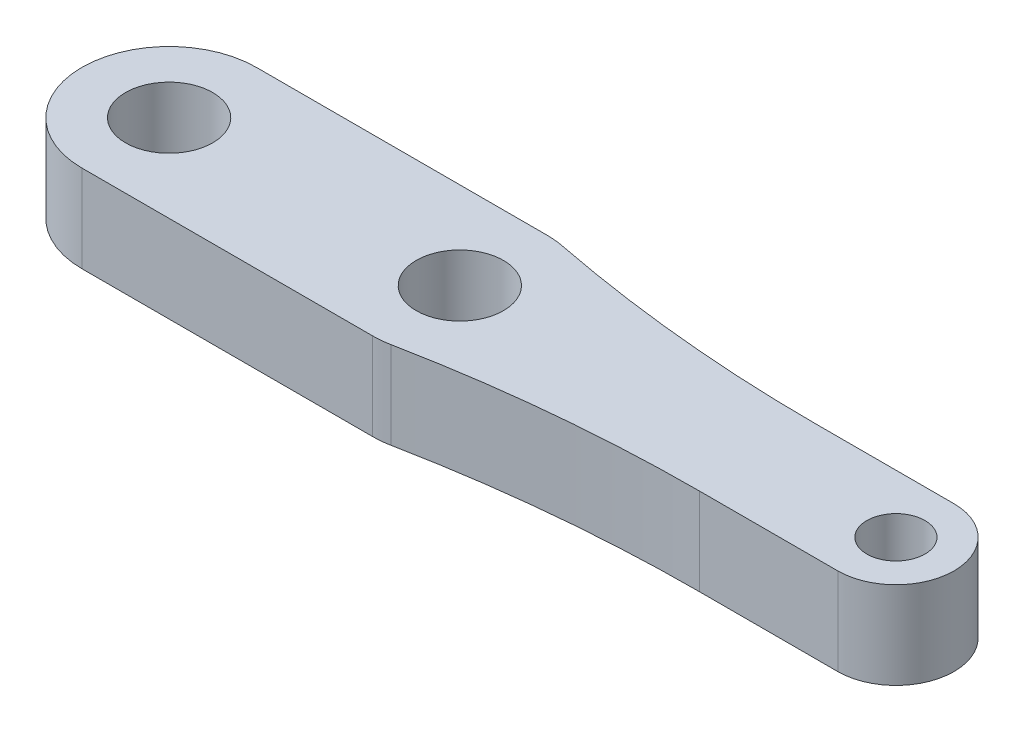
ISO-10303-21;
HEADER;
FILE_DESCRIPTION(('STEP AP214'),'2;1');
FILE_NAME('part.step','',(''),(''),'','','');
FILE_SCHEMA(('AUTOMOTIVE_DESIGN { 1 0 10303 214 1 1 1 1 }'));
ENDSEC;
DATA;
#1=APPLICATION_CONTEXT('core data for automotive mechanical design processes');
#2=APPLICATION_PROTOCOL_DEFINITION('international standard','automotive_design',2000,#1);
#3=PRODUCT_CONTEXT('',#1,'mechanical');
#4=PRODUCT('Part','Part','',(#3));
#5=PRODUCT_RELATED_PRODUCT_CATEGORY('part','',(#4));
#6=PRODUCT_DEFINITION_FORMATION('','',#4);
#7=PRODUCT_DEFINITION_CONTEXT('part definition',#1,'design');
#8=PRODUCT_DEFINITION('design','',#6,#7);
#9=PRODUCT_DEFINITION_SHAPE('','',#8);
#10=(LENGTH_UNIT() NAMED_UNIT(*) SI_UNIT(.MILLI.,.METRE.));
#11=(NAMED_UNIT(*) PLANE_ANGLE_UNIT() SI_UNIT($,.RADIAN.));
#12=(NAMED_UNIT(*) SI_UNIT($,.STERADIAN.) SOLID_ANGLE_UNIT());
#13=UNCERTAINTY_MEASURE_WITH_UNIT(LENGTH_MEASURE(1.E-05),#10,'distance_accuracy_value','');
#14=(GEOMETRIC_REPRESENTATION_CONTEXT(3) GLOBAL_UNCERTAINTY_ASSIGNED_CONTEXT((#13)) GLOBAL_UNIT_ASSIGNED_CONTEXT((#10,
#11,#12)) REPRESENTATION_CONTEXT('',''));
#15=CARTESIAN_POINT('',(0.,0.,0.));
#16=DIRECTION('',(0.,0.,1.));
#17=DIRECTION('',(1.,0.,0.));
#18=AXIS2_PLACEMENT_3D('',#15,#16,#17);
#19=CARTESIAN_POINT('',(0.,3.,2.));
#20=DIRECTION('',(0.,0.,1.));
#21=DIRECTION('',(1.,0.,0.));
#22=AXIS2_PLACEMENT_3D('',#19,#20,#21);
#23=PLANE('',#22);
#24=DIRECTION('',(-1.,0.,0.));
#25=VECTOR('',#24,1.);
#26=CARTESIAN_POINT('',(0.,3.,2.));
#27=LINE('',#26,#25);
#28=CARTESIAN_POINT('',(25.,3.,2.));
#29=VERTEX_POINT('',#28);
#30=CARTESIAN_POINT('',(20.2469507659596,3.,2.));
#31=VERTEX_POINT('',#30);
#32=EDGE_CURVE('E129',#29,#31,#27,.T.);
#33=ORIENTED_EDGE('',*,*,#32,.T.);
#34=DIRECTION('',(0.,-1.,0.));
#35=VECTOR('',#34,1.);
#36=CARTESIAN_POINT('',(20.2469507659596,3.,2.));
#37=LINE('',#36,#35);
#38=CARTESIAN_POINT('',(20.2469507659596,0.,2.));
#39=VERTEX_POINT('',#38);
#40=EDGE_CURVE('E137',#31,#39,#37,.T.);
#41=ORIENTED_EDGE('',*,*,#40,.T.);
#42=DIRECTION('',(-1.,0.,0.));
#43=VECTOR('',#42,1.);
#44=CARTESIAN_POINT('',(0.,0.,2.));
#45=LINE('',#44,#43);
#46=CARTESIAN_POINT('',(25.,0.,2.));
#47=VERTEX_POINT('',#46);
#48=EDGE_CURVE('E132',#47,#39,#45,.T.);
#49=ORIENTED_EDGE('',*,*,#48,.F.);
#50=DIRECTION('',(0.,-1.,0.));
#51=VECTOR('',#50,1.);
#52=CARTESIAN_POINT('',(25.,3.,2.));
#53=LINE('',#52,#51);
#54=EDGE_CURVE('E125',#29,#47,#53,.T.);
#55=ORIENTED_EDGE('',*,*,#54,.F.);
#56=EDGE_LOOP('',(#33,#41,#49,#55));
#57=FACE_BOUND('',#56,.T.);
#58=ADVANCED_FACE('F49',(#57),#23,.T.);
#59=CARTESIAN_POINT('',(25.,3.,0.));
#60=DIRECTION('',(0.,-1.,0.));
#61=DIRECTION('',(0.,0.,-1.));
#62=AXIS2_PLACEMENT_3D('',#59,#60,#61);
#63=CYLINDRICAL_SURFACE('',#62,2.);
#64=CARTESIAN_POINT('',(25.,0.,0.));
#65=DIRECTION('',(0.,1.,0.));
#66=DIRECTION('',(0.,0.,1.));
#67=AXIS2_PLACEMENT_3D('',#64,#65,#66);
#68=CIRCLE('',#67,2.);
#69=CARTESIAN_POINT('',(25.,0.,-2.));
#70=VERTEX_POINT('',#69);
#71=EDGE_CURVE('E195',#47,#70,#68,.T.);
#72=ORIENTED_EDGE('',*,*,#71,.T.);
#73=DIRECTION('',(0.,-1.,0.));
#74=VECTOR('',#73,1.);
#75=CARTESIAN_POINT('',(25.,3.,-2.));
#76=LINE('',#75,#74);
#77=CARTESIAN_POINT('',(25.,3.,-2.));
#78=VERTEX_POINT('',#77);
#79=EDGE_CURVE('E138',#78,#70,#76,.T.);
#80=ORIENTED_EDGE('',*,*,#79,.F.);
#81=CARTESIAN_POINT('',(25.,3.,0.));
#82=DIRECTION('',(0.,1.,0.));
#83=DIRECTION('',(0.,0.,1.));
#84=AXIS2_PLACEMENT_3D('',#81,#82,#83);
#85=CIRCLE('',#84,2.);
#86=EDGE_CURVE('E142',#29,#78,#85,.T.);
#87=ORIENTED_EDGE('',*,*,#86,.F.);
#88=ORIENTED_EDGE('',*,*,#54,.T.);
#89=EDGE_LOOP('',(#72,#80,#87,#88));
#90=FACE_BOUND('',#89,.T.);
#91=ADVANCED_FACE('F143',(#90),#63,.T.);
#92=CARTESIAN_POINT('',(0.,3.,-2.));
#93=DIRECTION('',(0.,0.,1.));
#94=DIRECTION('',(1.,0.,0.));
#95=AXIS2_PLACEMENT_3D('',#92,#93,#94);
#96=PLANE('',#95);
#97=DIRECTION('',(-1.,0.,0.));
#98=VECTOR('',#97,1.);
#99=CARTESIAN_POINT('',(0.,0.,-2.));
#100=LINE('',#99,#98);
#101=CARTESIAN_POINT('',(20.2469507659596,0.,-2.));
#102=VERTEX_POINT('',#101);
#103=EDGE_CURVE('E198',#70,#102,#100,.T.);
#104=ORIENTED_EDGE('',*,*,#103,.T.);
#105=DIRECTION('',(0.,1.,0.));
#106=VECTOR('',#105,1.);
#107=CARTESIAN_POINT('',(20.2469507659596,3.,-2.));
#108=LINE('',#107,#106);
#109=CARTESIAN_POINT('',(20.2469507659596,3.,-2.));
#110=VERTEX_POINT('',#109);
#111=EDGE_CURVE('E65',#102,#110,#108,.T.);
#112=ORIENTED_EDGE('',*,*,#111,.T.);
#113=DIRECTION('',(-1.,0.,0.));
#114=VECTOR('',#113,1.);
#115=CARTESIAN_POINT('',(0.,3.,-2.));
#116=LINE('',#115,#114);
#117=EDGE_CURVE('E147',#78,#110,#116,.T.);
#118=ORIENTED_EDGE('',*,*,#117,.F.);
#119=ORIENTED_EDGE('',*,*,#79,.T.);
#120=EDGE_LOOP('',(#104,#112,#118,#119));
#121=FACE_BOUND('',#120,.T.);
#122=ADVANCED_FACE('F265',(#121),#96,.F.);
#123=CARTESIAN_POINT('',(10.,3.,0.));
#124=DIRECTION('',(0.,-1.,0.));
#125=DIRECTION('',(0.,0.,-1.));
#126=AXIS2_PLACEMENT_3D('',#123,#124,#125);
#127=CYLINDRICAL_SURFACE('',#126,3.);
#128=CARTESIAN_POINT('',(10.,3.,0.));
#129=DIRECTION('',(0.,1.,0.));
#130=DIRECTION('',(0.,0.,1.));
#131=AXIS2_PLACEMENT_3D('',#128,#129,#130);
#132=CIRCLE('',#131,3.);
#133=CARTESIAN_POINT('',(10.5800160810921,3.,-2.94339622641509));
#134=VERTEX_POINT('',#133);
#135=CARTESIAN_POINT('',(10.,3.,-3.));
#136=VERTEX_POINT('',#135);
#137=EDGE_CURVE('E164',#134,#136,#132,.T.);
#138=ORIENTED_EDGE('',*,*,#137,.F.);
#139=DIRECTION('',(0.,-1.,0.));
#140=VECTOR('',#139,1.);
#141=CARTESIAN_POINT('',(10.5800160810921,3.,-2.94339622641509));
#142=LINE('',#141,#140);
#143=CARTESIAN_POINT('',(10.5800160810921,0.,-2.94339622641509));
#144=VERTEX_POINT('',#143);
#145=EDGE_CURVE('E245',#134,#144,#142,.T.);
#146=ORIENTED_EDGE('',*,*,#145,.T.);
#147=CARTESIAN_POINT('',(10.,0.,0.));
#148=DIRECTION('',(0.,1.,0.));
#149=DIRECTION('',(0.,0.,1.));
#150=AXIS2_PLACEMENT_3D('',#147,#148,#149);
#151=CIRCLE('',#150,3.);
#152=CARTESIAN_POINT('',(10.,0.,-3.));
#153=VERTEX_POINT('',#152);
#154=EDGE_CURVE('E201',#144,#153,#151,.T.);
#155=ORIENTED_EDGE('',*,*,#154,.T.);
#156=DIRECTION('',(0.,-1.,0.));
#157=VECTOR('',#156,1.);
#158=CARTESIAN_POINT('',(10.,3.,-3.));
#159=LINE('',#158,#157);
#160=EDGE_CURVE('E234',#136,#153,#159,.T.);
#161=ORIENTED_EDGE('',*,*,#160,.F.);
#162=EDGE_LOOP('',(#138,#146,#155,#161));
#163=FACE_BOUND('',#162,.T.);
#164=ADVANCED_FACE('F271',(#163),#127,.T.);
#165=CARTESIAN_POINT('',(0.,3.,-3.));
#166=DIRECTION('',(0.,0.,-1.));
#167=DIRECTION('',(-1.,0.,0.));
#168=AXIS2_PLACEMENT_3D('',#165,#166,#167);
#169=PLANE('',#168);
#170=DIRECTION('',(1.,0.,0.));
#171=VECTOR('',#170,1.);
#172=CARTESIAN_POINT('',(0.,0.,-3.));
#173=LINE('',#172,#171);
#174=CARTESIAN_POINT('',(0.,0.,-3.));
#175=VERTEX_POINT('',#174);
#176=EDGE_CURVE('E204',#175,#153,#173,.T.);
#177=ORIENTED_EDGE('',*,*,#176,.F.);
#178=DIRECTION('',(0.,-1.,0.));
#179=VECTOR('',#178,1.);
#180=CARTESIAN_POINT('',(0.,3.,-3.));
#181=LINE('',#180,#179);
#182=CARTESIAN_POINT('',(0.,3.,-3.));
#183=VERTEX_POINT('',#182);
#184=EDGE_CURVE('E231',#183,#175,#181,.T.);
#185=ORIENTED_EDGE('',*,*,#184,.F.);
#186=DIRECTION('',(1.,0.,0.));
#187=VECTOR('',#186,1.);
#188=CARTESIAN_POINT('',(0.,3.,-3.));
#189=LINE('',#188,#187);
#190=EDGE_CURVE('E167',#183,#136,#189,.T.);
#191=ORIENTED_EDGE('',*,*,#190,.T.);
#192=ORIENTED_EDGE('',*,*,#160,.T.);
#193=EDGE_LOOP('',(#177,#185,#191,#192));
#194=FACE_BOUND('',#193,.T.);
#195=ADVANCED_FACE('F276',(#194),#169,.T.);
#196=CARTESIAN_POINT('',(0.,3.,0.));
#197=DIRECTION('',(0.,-1.,0.));
#198=DIRECTION('',(0.,0.,-1.));
#199=AXIS2_PLACEMENT_3D('',#196,#197,#198);
#200=CYLINDRICAL_SURFACE('',#199,3.);
#201=CARTESIAN_POINT('',(0.,0.,0.));
#202=DIRECTION('',(0.,1.,0.));
#203=DIRECTION('',(0.,0.,1.));
#204=AXIS2_PLACEMENT_3D('',#201,#202,#203);
#205=CIRCLE('',#204,3.);
#206=CARTESIAN_POINT('',(0.,0.,3.));
#207=VERTEX_POINT('',#206);
#208=EDGE_CURVE('E209',#175,#207,#205,.T.);
#209=ORIENTED_EDGE('',*,*,#208,.T.);
#210=DIRECTION('',(0.,-1.,0.));
#211=VECTOR('',#210,1.);
#212=CARTESIAN_POINT('',(0.,3.,3.));
#213=LINE('',#212,#211);
#214=CARTESIAN_POINT('',(0.,3.,3.));
#215=VERTEX_POINT('',#214);
#216=EDGE_CURVE('E227',#215,#207,#213,.T.);
#217=ORIENTED_EDGE('',*,*,#216,.F.);
#218=CARTESIAN_POINT('',(0.,3.,0.));
#219=DIRECTION('',(0.,1.,0.));
#220=DIRECTION('',(0.,0.,1.));
#221=AXIS2_PLACEMENT_3D('',#218,#219,#220);
#222=CIRCLE('',#221,3.);
#223=EDGE_CURVE('E172',#183,#215,#222,.T.);
#224=ORIENTED_EDGE('',*,*,#223,.F.);
#225=ORIENTED_EDGE('',*,*,#184,.T.);
#226=EDGE_LOOP('',(#209,#217,#224,#225));
#227=FACE_BOUND('',#226,.T.);
#228=ADVANCED_FACE('F281',(#227),#200,.T.);
#229=CARTESIAN_POINT('',(0.,3.,3.));
#230=DIRECTION('',(0.,0.,-1.));
#231=DIRECTION('',(-1.,0.,0.));
#232=AXIS2_PLACEMENT_3D('',#229,#230,#231);
#233=PLANE('',#232);
#234=DIRECTION('',(1.,0.,0.));
#235=VECTOR('',#234,1.);
#236=CARTESIAN_POINT('',(0.,0.,3.));
#237=LINE('',#236,#235);
#238=CARTESIAN_POINT('',(10.,0.,3.));
#239=VERTEX_POINT('',#238);
#240=EDGE_CURVE('E213',#207,#239,#237,.T.);
#241=ORIENTED_EDGE('',*,*,#240,.T.);
#242=DIRECTION('',(0.,-1.,0.));
#243=VECTOR('',#242,1.);
#244=CARTESIAN_POINT('',(10.,3.,3.));
#245=LINE('',#244,#243);
#246=CARTESIAN_POINT('',(10.,3.,3.));
#247=VERTEX_POINT('',#246);
#248=EDGE_CURVE('E188',#247,#239,#245,.T.);
#249=ORIENTED_EDGE('',*,*,#248,.F.);
#250=DIRECTION('',(1.,0.,0.));
#251=VECTOR('',#250,1.);
#252=CARTESIAN_POINT('',(0.,3.,3.));
#253=LINE('',#252,#251);
#254=EDGE_CURVE('E176',#215,#247,#253,.T.);
#255=ORIENTED_EDGE('',*,*,#254,.F.);
#256=ORIENTED_EDGE('',*,*,#216,.T.);
#257=EDGE_LOOP('',(#241,#249,#255,#256));
#258=FACE_BOUND('',#257,.T.);
#259=ADVANCED_FACE('F283',(#258),#233,.F.);
#260=CARTESIAN_POINT('',(10.,3.,0.));
#261=DIRECTION('',(0.,-1.,0.));
#262=DIRECTION('',(0.,0.,-1.));
#263=AXIS2_PLACEMENT_3D('',#260,#261,#262);
#264=CYLINDRICAL_SURFACE('',#263,1.5);
#265=CARTESIAN_POINT('',(10.,3.,0.));
#266=DIRECTION('',(0.,1.,0.));
#267=DIRECTION('',(0.,0.,1.));
#268=AXIS2_PLACEMENT_3D('',#265,#266,#267);
#269=CIRCLE('',#268,1.5);
#270=CARTESIAN_POINT('',(10.,3.,1.5));
#271=VERTEX_POINT('',#270);
#272=EDGE_CURVE('E180',#271,#271,#269,.T.);
#273=ORIENTED_EDGE('',*,*,#272,.T.);
#274=EDGE_LOOP('',(#273));
#275=FACE_BOUND('',#274,.T.);
#276=CARTESIAN_POINT('',(10.,0.,0.));
#277=DIRECTION('',(0.,1.,0.));
#278=DIRECTION('',(0.,0.,1.));
#279=AXIS2_PLACEMENT_3D('',#276,#277,#278);
#280=CIRCLE('',#279,1.5);
#281=CARTESIAN_POINT('',(10.,0.,1.5));
#282=VERTEX_POINT('',#281);
#283=EDGE_CURVE('E217',#282,#282,#280,.T.);
#284=ORIENTED_EDGE('',*,*,#283,.F.);
#285=EDGE_LOOP('',(#284));
#286=FACE_BOUND('',#285,.T.);
#287=ADVANCED_FACE('F288',(#275,#286),#264,.F.);
#288=CARTESIAN_POINT('',(10.5800160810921,0.,2.94339622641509));
#289=VERTEX_POINT('',#288);
#290=EDGE_CURVE('E205',#239,#289,#151,.T.);
#291=ORIENTED_EDGE('',*,*,#290,.T.);
#292=DIRECTION('',(0.,-1.,0.));
#293=VECTOR('',#292,1.);
#294=CARTESIAN_POINT('',(10.5800160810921,3.,2.94339622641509));
#295=LINE('',#294,#293);
#296=CARTESIAN_POINT('',(10.5800160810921,3.,2.94339622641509));
#297=VERTEX_POINT('',#296);
#298=EDGE_CURVE('E242',#289,#297,#295,.F.);
#299=ORIENTED_EDGE('',*,*,#298,.T.);
#300=EDGE_CURVE('E168',#247,#297,#132,.T.);
#301=ORIENTED_EDGE('',*,*,#300,.F.);
#302=ORIENTED_EDGE('',*,*,#248,.T.);
#303=EDGE_LOOP('',(#291,#299,#301,#302));
#304=FACE_BOUND('',#303,.T.);
#305=ADVANCED_FACE('F284',(#304),#127,.T.);
#306=CARTESIAN_POINT('',(25.,3.,0.));
#307=DIRECTION('',(0.,-1.,0.));
#308=DIRECTION('',(0.,0.,-1.));
#309=AXIS2_PLACEMENT_3D('',#306,#307,#308);
#310=CYLINDRICAL_SURFACE('',#309,1.);
#311=CARTESIAN_POINT('',(25.,3.,0.));
#312=DIRECTION('',(0.,1.,0.));
#313=DIRECTION('',(0.,0.,1.));
#314=AXIS2_PLACEMENT_3D('',#311,#312,#313);
#315=CIRCLE('',#314,1.);
#316=CARTESIAN_POINT('',(25.,3.,1.));
#317=VERTEX_POINT('',#316);
#318=EDGE_CURVE('E155',#317,#317,#315,.T.);
#319=ORIENTED_EDGE('',*,*,#318,.T.);
#320=EDGE_LOOP('',(#319));
#321=FACE_BOUND('',#320,.T.);
#322=CARTESIAN_POINT('',(25.,0.,0.));
#323=DIRECTION('',(0.,1.,0.));
#324=DIRECTION('',(0.,0.,1.));
#325=AXIS2_PLACEMENT_3D('',#322,#323,#324);
#326=CIRCLE('',#325,1.);
#327=CARTESIAN_POINT('',(25.,0.,1.));
#328=VERTEX_POINT('',#327);
#329=EDGE_CURVE('E189',#328,#328,#326,.T.);
#330=ORIENTED_EDGE('',*,*,#329,.F.);
#331=EDGE_LOOP('',(#330));
#332=FACE_BOUND('',#331,.T.);
#333=ADVANCED_FACE('F287',(#321,#332),#310,.F.);
#334=CARTESIAN_POINT('',(0.,3.,0.));
#335=DIRECTION('',(0.,-1.,0.));
#336=DIRECTION('',(0.,0.,-1.));
#337=AXIS2_PLACEMENT_3D('',#334,#335,#336);
#338=CYLINDRICAL_SURFACE('',#337,1.5);
#339=CARTESIAN_POINT('',(0.,3.,0.));
#340=DIRECTION('',(0.,1.,0.));
#341=DIRECTION('',(0.,0.,1.));
#342=AXIS2_PLACEMENT_3D('',#339,#340,#341);
#343=CIRCLE('',#342,1.5);
#344=CARTESIAN_POINT('',(0.,3.,1.5));
#345=VERTEX_POINT('',#344);
#346=EDGE_CURVE('E184',#345,#345,#343,.T.);
#347=ORIENTED_EDGE('',*,*,#346,.T.);
#348=EDGE_LOOP('',(#347));
#349=FACE_BOUND('',#348,.T.);
#350=CARTESIAN_POINT('',(0.,0.,0.));
#351=DIRECTION('',(0.,1.,0.));
#352=DIRECTION('',(0.,0.,1.));
#353=AXIS2_PLACEMENT_3D('',#350,#351,#352);
#354=CIRCLE('',#353,1.5);
#355=CARTESIAN_POINT('',(0.,0.,1.5));
#356=VERTEX_POINT('',#355);
#357=EDGE_CURVE('E159',#356,#356,#354,.T.);
#358=ORIENTED_EDGE('',*,*,#357,.F.);
#359=EDGE_LOOP('',(#358));
#360=FACE_BOUND('',#359,.T.);
#361=ADVANCED_FACE('F295',(#349,#360),#338,.F.);
#362=CARTESIAN_POINT('',(0.,3.,0.));
#363=DIRECTION('',(0.,1.,0.));
#364=DIRECTION('',(0.,0.,1.));
#365=AXIS2_PLACEMENT_3D('',#362,#363,#364);
#366=PLANE('',#365);
#367=ORIENTED_EDGE('',*,*,#318,.F.);
#368=EDGE_LOOP('',(#367));
#369=FACE_BOUND('',#368,.T.);
#370=ORIENTED_EDGE('',*,*,#32,.F.);
#371=ORIENTED_EDGE('',*,*,#86,.T.);
#372=ORIENTED_EDGE('',*,*,#117,.T.);
#373=CARTESIAN_POINT('',(20.2469507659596,3.,-52.));
#374=DIRECTION('',(0.,1.,0.));
#375=DIRECTION('',(0.,0.,1.));
#376=AXIS2_PLACEMENT_3D('',#373,#374,#375);
#377=CIRCLE('',#376,50.);
#378=EDGE_CURVE('E11',#110,#134,#377,.F.);
#379=ORIENTED_EDGE('',*,*,#378,.T.);
#380=ORIENTED_EDGE('',*,*,#137,.T.);
#381=ORIENTED_EDGE('',*,*,#190,.F.);
#382=ORIENTED_EDGE('',*,*,#223,.T.);
#383=ORIENTED_EDGE('',*,*,#254,.T.);
#384=ORIENTED_EDGE('',*,*,#300,.T.);
#385=CARTESIAN_POINT('',(20.2469507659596,3.,52.));
#386=DIRECTION('',(0.,1.,0.));
#387=DIRECTION('',(0.,0.,1.));
#388=AXIS2_PLACEMENT_3D('',#385,#386,#387);
#389=CIRCLE('',#388,50.);
#390=EDGE_CURVE('E153',#297,#31,#389,.F.);
#391=ORIENTED_EDGE('',*,*,#390,.T.);
#392=EDGE_LOOP('',(#370,#371,#372,#379,#380,#381,#382,#383,#384,#391));
#393=FACE_BOUND('',#392,.T.);
#394=ORIENTED_EDGE('',*,*,#272,.F.);
#395=EDGE_LOOP('',(#394));
#396=FACE_BOUND('',#395,.T.);
#397=ORIENTED_EDGE('',*,*,#346,.F.);
#398=EDGE_LOOP('',(#397));
#399=FACE_BOUND('',#398,.T.);
#400=ADVANCED_FACE('F149',(#369,#393,#396,#399),#366,.T.);
#401=CARTESIAN_POINT('',(0.,0.,0.));
#402=DIRECTION('',(0.,1.,0.));
#403=DIRECTION('',(0.,0.,1.));
#404=AXIS2_PLACEMENT_3D('',#401,#402,#403);
#405=PLANE('',#404);
#406=ORIENTED_EDGE('',*,*,#329,.T.);
#407=EDGE_LOOP('',(#406));
#408=FACE_BOUND('',#407,.T.);
#409=ORIENTED_EDGE('',*,*,#48,.T.);
#410=CARTESIAN_POINT('',(20.2469507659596,0.,52.));
#411=DIRECTION('',(0.,1.,0.));
#412=DIRECTION('',(0.,0.,1.));
#413=AXIS2_PLACEMENT_3D('',#410,#411,#412);
#414=CIRCLE('',#413,50.);
#415=EDGE_CURVE('E251',#39,#289,#414,.T.);
#416=ORIENTED_EDGE('',*,*,#415,.T.);
#417=ORIENTED_EDGE('',*,*,#290,.F.);
#418=ORIENTED_EDGE('',*,*,#240,.F.);
#419=ORIENTED_EDGE('',*,*,#208,.F.);
#420=ORIENTED_EDGE('',*,*,#176,.T.);
#421=ORIENTED_EDGE('',*,*,#154,.F.);
#422=CARTESIAN_POINT('',(20.2469507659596,0.,-52.));
#423=DIRECTION('',(0.,1.,0.));
#424=DIRECTION('',(0.,0.,1.));
#425=AXIS2_PLACEMENT_3D('',#422,#423,#424);
#426=CIRCLE('',#425,50.);
#427=EDGE_CURVE('E58',#144,#102,#426,.T.);
#428=ORIENTED_EDGE('',*,*,#427,.T.);
#429=ORIENTED_EDGE('',*,*,#103,.F.);
#430=ORIENTED_EDGE('',*,*,#71,.F.);
#431=EDGE_LOOP('',(#409,#416,#417,#418,#419,#420,#421,#428,#429,#430));
#432=FACE_BOUND('',#431,.T.);
#433=ORIENTED_EDGE('',*,*,#283,.T.);
#434=EDGE_LOOP('',(#433));
#435=FACE_BOUND('',#434,.T.);
#436=ORIENTED_EDGE('',*,*,#357,.T.);
#437=EDGE_LOOP('',(#436));
#438=FACE_BOUND('',#437,.T.);
#439=ADVANCED_FACE('F262',(#408,#432,#435,#438),#405,.F.);
#440=CARTESIAN_POINT('',(20.2469507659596,3.,52.));
#441=DIRECTION('',(0.,-1.,0.));
#442=DIRECTION('',(0.,0.,-1.));
#443=AXIS2_PLACEMENT_3D('',#440,#441,#442);
#444=CYLINDRICAL_SURFACE('',#443,50.);
#445=ORIENTED_EDGE('',*,*,#390,.F.);
#446=ORIENTED_EDGE('',*,*,#298,.F.);
#447=ORIENTED_EDGE('',*,*,#415,.F.);
#448=ORIENTED_EDGE('',*,*,#40,.F.);
#449=EDGE_LOOP('',(#445,#446,#447,#448));
#450=FACE_BOUND('',#449,.T.);
#451=ADVANCED_FACE('F261',(#450),#444,.F.);
#452=CARTESIAN_POINT('',(20.2469507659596,3.,-52.));
#453=DIRECTION('',(0.,-1.,0.));
#454=DIRECTION('',(0.,0.,-1.));
#455=AXIS2_PLACEMENT_3D('',#452,#453,#454);
#456=CYLINDRICAL_SURFACE('',#455,50.);
#457=ORIENTED_EDGE('',*,*,#378,.F.);
#458=ORIENTED_EDGE('',*,*,#111,.F.);
#459=ORIENTED_EDGE('',*,*,#427,.F.);
#460=ORIENTED_EDGE('',*,*,#145,.F.);
#461=EDGE_LOOP('',(#457,#458,#459,#460));
#462=FACE_BOUND('',#461,.T.);
#463=ADVANCED_FACE('F51',(#462),#456,.F.);
#464=CLOSED_SHELL('',(#58,#91,#122,#164,#195,#228,#259,#287,#305,#333,#361,#400,#439,#451,#463));
#465=MANIFOLD_SOLID_BREP('B2',#464);
#466=ADVANCED_BREP_SHAPE_REPRESENTATION('',(#18,#465),#14);
#467=SHAPE_DEFINITION_REPRESENTATION(#9,#466);
ENDSEC;
END-ISO-10303-21;
